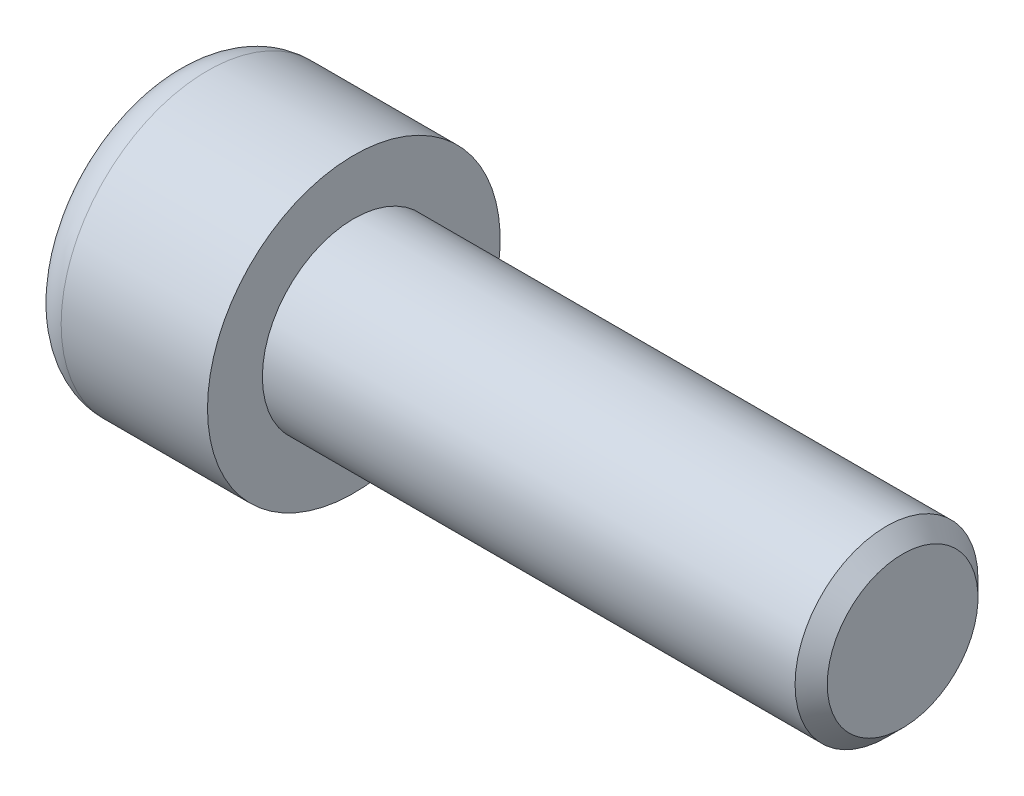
ISO-10303-21;
HEADER;
FILE_DESCRIPTION(('STEP AP214'),'2;1');
FILE_NAME('part.step','',(''),(''),'','','');
FILE_SCHEMA(('AUTOMOTIVE_DESIGN { 1 0 10303 214 1 1 1 1 }'));
ENDSEC;
DATA;
#1=APPLICATION_CONTEXT('core data for automotive mechanical design processes');
#2=APPLICATION_PROTOCOL_DEFINITION('international standard','automotive_design',2000,#1);
#3=PRODUCT_CONTEXT('',#1,'mechanical');
#4=PRODUCT('Part','Part','',(#3));
#5=PRODUCT_RELATED_PRODUCT_CATEGORY('part','',(#4));
#6=PRODUCT_DEFINITION_FORMATION('','',#4);
#7=PRODUCT_DEFINITION_CONTEXT('part definition',#1,'design');
#8=PRODUCT_DEFINITION('design','',#6,#7);
#9=PRODUCT_DEFINITION_SHAPE('','',#8);
#10=(LENGTH_UNIT() NAMED_UNIT(*) SI_UNIT(.MILLI.,.METRE.));
#11=(NAMED_UNIT(*) PLANE_ANGLE_UNIT() SI_UNIT($,.RADIAN.));
#12=(NAMED_UNIT(*) SI_UNIT($,.STERADIAN.) SOLID_ANGLE_UNIT());
#13=UNCERTAINTY_MEASURE_WITH_UNIT(LENGTH_MEASURE(1.E-05),#10,'distance_accuracy_value','');
#14=(GEOMETRIC_REPRESENTATION_CONTEXT(3) GLOBAL_UNCERTAINTY_ASSIGNED_CONTEXT((#13)) GLOBAL_UNIT_ASSIGNED_CONTEXT((#10,
#11,#12)) REPRESENTATION_CONTEXT('',''));
#15=CARTESIAN_POINT('',(0.,0.,0.));
#16=DIRECTION('',(0.,0.,1.));
#17=DIRECTION('',(1.,0.,0.));
#18=AXIS2_PLACEMENT_3D('',#15,#16,#17);
#19=CARTESIAN_POINT('',(-12.,0.,0.));
#20=DIRECTION('',(1.,0.,0.));
#21=DIRECTION('',(0.,0.,-1.));
#22=AXIS2_PLACEMENT_3D('',#19,#20,#21);
#23=PLANE('',#22);
#24=CARTESIAN_POINT('',(-12.,0.,0.));
#25=DIRECTION('',(1.,0.,0.));
#26=DIRECTION('',(0.,0.,-1.));
#27=AXIS2_PLACEMENT_3D('',#24,#25,#26);
#28=CIRCLE('',#27,6.);
#29=CARTESIAN_POINT('',(-12.,0.,-6.));
#30=VERTEX_POINT('',#29);
#31=EDGE_CURVE('E40',#30,#30,#28,.F.);
#32=ORIENTED_EDGE('',*,*,#31,.T.);
#33=EDGE_LOOP('',(#32));
#34=FACE_BOUND('',#33,.T.);
#35=DIRECTION('',(0.,-1.,0.));
#36=VECTOR('',#35,1.);
#37=CARTESIAN_POINT('',(-12.,2.30940107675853,-4.00000000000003));
#38=LINE('',#37,#36);
#39=CARTESIAN_POINT('',(-12.,2.30940107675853,-4.00000000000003));
#40=VERTEX_POINT('',#39);
#41=CARTESIAN_POINT('',(-12.,-2.30940107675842,-3.99999999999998));
#42=VERTEX_POINT('',#41);
#43=EDGE_CURVE('E101',#40,#42,#38,.T.);
#44=ORIENTED_EDGE('',*,*,#43,.F.);
#45=DIRECTION('',(0.,-0.5,-0.866025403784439));
#46=VECTOR('',#45,1.);
#47=CARTESIAN_POINT('',(-12.,4.61880215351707,0.));
#48=LINE('',#47,#46);
#49=CARTESIAN_POINT('',(-12.,4.61880215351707,0.));
#50=VERTEX_POINT('',#49);
#51=EDGE_CURVE('E47',#50,#40,#48,.T.);
#52=ORIENTED_EDGE('',*,*,#51,.F.);
#53=DIRECTION('',(0.,0.5,-0.866025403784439));
#54=VECTOR('',#53,1.);
#55=CARTESIAN_POINT('',(-12.,4.61880215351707,0.));
#56=LINE('',#55,#54);
#57=CARTESIAN_POINT('',(-12.,2.30940107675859,4.));
#58=VERTEX_POINT('',#57);
#59=EDGE_CURVE('E115',#58,#50,#56,.T.);
#60=ORIENTED_EDGE('',*,*,#59,.F.);
#61=DIRECTION('',(0.,1.,0.));
#62=VECTOR('',#61,1.);
#63=CARTESIAN_POINT('',(-12.,2.30940107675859,4.));
#64=LINE('',#63,#62);
#65=CARTESIAN_POINT('',(-12.,-2.30940107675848,4.00000000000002));
#66=VERTEX_POINT('',#65);
#67=EDGE_CURVE('E109',#66,#58,#64,.T.);
#68=ORIENTED_EDGE('',*,*,#67,.F.);
#69=DIRECTION('',(0.,0.5,0.866025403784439));
#70=VECTOR('',#69,1.);
#71=CARTESIAN_POINT('',(-12.,-4.61880215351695,0.));
#72=LINE('',#71,#70);
#73=CARTESIAN_POINT('',(-12.,-4.61880215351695,0.));
#74=VERTEX_POINT('',#73);
#75=EDGE_CURVE('E107',#74,#66,#72,.T.);
#76=ORIENTED_EDGE('',*,*,#75,.F.);
#77=DIRECTION('',(0.,-0.5,0.866025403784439));
#78=VECTOR('',#77,1.);
#79=CARTESIAN_POINT('',(-12.,-2.30940107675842,-3.99999999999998));
#80=LINE('',#79,#78);
#81=EDGE_CURVE('E90',#42,#74,#80,.T.);
#82=ORIENTED_EDGE('',*,*,#81,.F.);
#83=EDGE_LOOP('',(#44,#52,#60,#68,#76,#82));
#84=FACE_BOUND('',#83,.T.);
#85=ADVANCED_FACE('F33',(#34,#84),#23,.F.);
#86=CARTESIAN_POINT('',(-18.8650217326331,0.,0.));
#87=DIRECTION('',(-1.,0.,0.));
#88=DIRECTION('',(0.,0.,1.));
#89=AXIS2_PLACEMENT_3D('',#86,#87,#88);
#90=CYLINDRICAL_SURFACE('',#89,8.);
#91=CARTESIAN_POINT('',(-10.,0.,0.));
#92=DIRECTION('',(1.,0.,0.));
#93=DIRECTION('',(0.,0.,-1.));
#94=AXIS2_PLACEMENT_3D('',#91,#92,#93);
#95=CIRCLE('',#94,8.);
#96=CARTESIAN_POINT('',(-10.,0.,-8.));
#97=VERTEX_POINT('',#96);
#98=EDGE_CURVE('E11',#97,#97,#95,.T.);
#99=ORIENTED_EDGE('',*,*,#98,.T.);
#100=EDGE_LOOP('',(#99));
#101=FACE_BOUND('',#100,.T.);
#102=CARTESIAN_POINT('',(-2.,0.,0.));
#103=DIRECTION('',(-1.,0.,0.));
#104=DIRECTION('',(0.,0.,1.));
#105=AXIS2_PLACEMENT_3D('',#102,#103,#104);
#106=CIRCLE('',#105,8.);
#107=CARTESIAN_POINT('',(-2.,0.,8.));
#108=VERTEX_POINT('',#107);
#109=EDGE_CURVE('E142',#108,#108,#106,.T.);
#110=ORIENTED_EDGE('',*,*,#109,.T.);
#111=EDGE_LOOP('',(#110));
#112=FACE_BOUND('',#111,.T.);
#113=ADVANCED_FACE('F166',(#101,#112),#90,.T.);
#114=CARTESIAN_POINT('',(-2.,8.00000000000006,0.));
#115=DIRECTION('',(-1.,0.,0.));
#116=DIRECTION('',(0.,0.,1.));
#117=AXIS2_PLACEMENT_3D('',#114,#115,#116);
#118=PLANE('',#117);
#119=ORIENTED_EDGE('',*,*,#109,.F.);
#120=EDGE_LOOP('',(#119));
#121=FACE_BOUND('',#120,.T.);
#122=CARTESIAN_POINT('',(-2.,0.,0.));
#123=DIRECTION('',(-1.,0.,0.));
#124=DIRECTION('',(0.,0.,1.));
#125=AXIS2_PLACEMENT_3D('',#122,#123,#124);
#126=CIRCLE('',#125,5.);
#127=CARTESIAN_POINT('',(-2.,0.,5.));
#128=VERTEX_POINT('',#127);
#129=EDGE_CURVE('E133',#128,#128,#126,.T.);
#130=ORIENTED_EDGE('',*,*,#129,.T.);
#131=EDGE_LOOP('',(#130));
#132=FACE_BOUND('',#131,.T.);
#133=ADVANCED_FACE('F170',(#121,#132),#118,.F.);
#134=CARTESIAN_POINT('',(-18.8650217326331,0.,0.));
#135=DIRECTION('',(-1.,0.,0.));
#136=DIRECTION('',(0.,0.,1.));
#137=AXIS2_PLACEMENT_3D('',#134,#135,#136);
#138=CYLINDRICAL_SURFACE('',#137,5.);
#139=CARTESIAN_POINT('',(27.12,0.,0.));
#140=DIRECTION('',(-1.,0.,0.));
#141=DIRECTION('',(0.,0.,1.));
#142=AXIS2_PLACEMENT_3D('',#139,#140,#141);
#143=CIRCLE('',#142,5.);
#144=CARTESIAN_POINT('',(27.12,0.,5.));
#145=VERTEX_POINT('',#144);
#146=EDGE_CURVE('E145',#145,#145,#143,.T.);
#147=ORIENTED_EDGE('',*,*,#146,.T.);
#148=EDGE_LOOP('',(#147));
#149=FACE_BOUND('',#148,.T.);
#150=ORIENTED_EDGE('',*,*,#129,.F.);
#151=EDGE_LOOP('',(#150));
#152=FACE_BOUND('',#151,.T.);
#153=ADVANCED_FACE('F175',(#149,#152),#138,.T.);
#154=CARTESIAN_POINT('',(28.,5.00000000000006,0.));
#155=DIRECTION('',(-1.,0.,0.));
#156=DIRECTION('',(0.,0.,1.));
#157=AXIS2_PLACEMENT_3D('',#154,#155,#156);
#158=PLANE('',#157);
#159=CARTESIAN_POINT('',(28.,0.,0.));
#160=DIRECTION('',(-1.,0.,0.));
#161=DIRECTION('',(0.,0.,1.));
#162=AXIS2_PLACEMENT_3D('',#159,#160,#161);
#163=CIRCLE('',#162,4.12000000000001);
#164=CARTESIAN_POINT('',(28.,0.,4.12000000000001));
#165=VERTEX_POINT('',#164);
#166=EDGE_CURVE('E148',#165,#165,#163,.F.);
#167=ORIENTED_EDGE('',*,*,#166,.T.);
#168=EDGE_LOOP('',(#167));
#169=FACE_BOUND('',#168,.T.);
#170=ADVANCED_FACE('F182',(#169),#158,.F.);
#171=CARTESIAN_POINT('',(27.12,0.,0.));
#172=DIRECTION('',(-1.,0.,0.));
#173=DIRECTION('',(0.,0.,1.));
#174=AXIS2_PLACEMENT_3D('',#171,#172,#173);
#175=CONICAL_SURFACE('',#174,5.,0.785398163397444);
#176=ORIENTED_EDGE('',*,*,#166,.F.);
#177=EDGE_LOOP('',(#176));
#178=FACE_BOUND('',#177,.T.);
#179=ORIENTED_EDGE('',*,*,#146,.F.);
#180=EDGE_LOOP('',(#179));
#181=FACE_BOUND('',#180,.T.);
#182=ADVANCED_FACE('F186',(#178,#181),#175,.T.);
#183=CARTESIAN_POINT('',(-3.,4.61880215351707,0.));
#184=DIRECTION('',(0.,0.866025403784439,-0.500000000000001));
#185=DIRECTION('',(0.,0.500000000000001,0.866025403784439));
#186=AXIS2_PLACEMENT_3D('',#183,#184,#185);
#187=PLANE('',#186);
#188=ORIENTED_EDGE('',*,*,#51,.T.);
#189=DIRECTION('',(-1.,0.,0.));
#190=VECTOR('',#189,1.);
#191=CARTESIAN_POINT('',(-3.,2.30940107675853,-4.00000000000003));
#192=LINE('',#191,#190);
#193=CARTESIAN_POINT('',(-3.,2.30940107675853,-4.00000000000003));
#194=VERTEX_POINT('',#193);
#195=EDGE_CURVE('E98',#194,#40,#192,.T.);
#196=ORIENTED_EDGE('',*,*,#195,.F.);
#197=DIRECTION('',(0.,-0.5,-0.866025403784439));
#198=VECTOR('',#197,1.);
#199=CARTESIAN_POINT('',(-3.,4.61880215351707,0.));
#200=LINE('',#199,#198);
#201=CARTESIAN_POINT('',(-3.,4.61880215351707,0.));
#202=VERTEX_POINT('',#201);
#203=EDGE_CURVE('E117',#202,#194,#200,.T.);
#204=ORIENTED_EDGE('',*,*,#203,.F.);
#205=DIRECTION('',(-1.,0.,0.));
#206=VECTOR('',#205,1.);
#207=CARTESIAN_POINT('',(-3.,4.61880215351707,0.));
#208=LINE('',#207,#206);
#209=EDGE_CURVE('E54',#202,#50,#208,.T.);
#210=ORIENTED_EDGE('',*,*,#209,.T.);
#211=EDGE_LOOP('',(#188,#196,#204,#210));
#212=FACE_BOUND('',#211,.T.);
#213=ADVANCED_FACE('F190',(#212),#187,.F.);
#214=CARTESIAN_POINT('',(-3.,4.61880215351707,0.));
#215=DIRECTION('',(0.,0.866025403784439,0.5));
#216=DIRECTION('',(0.,-0.5,0.866025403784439));
#217=AXIS2_PLACEMENT_3D('',#214,#215,#216);
#218=PLANE('',#217);
#219=ORIENTED_EDGE('',*,*,#59,.T.);
#220=ORIENTED_EDGE('',*,*,#209,.F.);
#221=DIRECTION('',(0.,0.5,-0.866025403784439));
#222=VECTOR('',#221,1.);
#223=CARTESIAN_POINT('',(-3.,4.61880215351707,0.));
#224=LINE('',#223,#222);
#225=CARTESIAN_POINT('',(-3.,2.30940107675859,4.));
#226=VERTEX_POINT('',#225);
#227=EDGE_CURVE('E129',#226,#202,#224,.T.);
#228=ORIENTED_EDGE('',*,*,#227,.F.);
#229=DIRECTION('',(-1.,0.,0.));
#230=VECTOR('',#229,1.);
#231=CARTESIAN_POINT('',(-3.,2.30940107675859,4.));
#232=LINE('',#231,#230);
#233=EDGE_CURVE('E134',#226,#58,#232,.T.);
#234=ORIENTED_EDGE('',*,*,#233,.T.);
#235=EDGE_LOOP('',(#219,#220,#228,#234));
#236=FACE_BOUND('',#235,.T.);
#237=ADVANCED_FACE('F194',(#236),#218,.F.);
#238=CARTESIAN_POINT('',(-3.,2.30940107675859,4.));
#239=DIRECTION('',(0.,0.,1.));
#240=DIRECTION('',(1.,0.,0.));
#241=AXIS2_PLACEMENT_3D('',#238,#239,#240);
#242=PLANE('',#241);
#243=ORIENTED_EDGE('',*,*,#67,.T.);
#244=ORIENTED_EDGE('',*,*,#233,.F.);
#245=DIRECTION('',(0.,1.,0.));
#246=VECTOR('',#245,1.);
#247=CARTESIAN_POINT('',(-3.,2.30940107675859,4.));
#248=LINE('',#247,#246);
#249=CARTESIAN_POINT('',(-3.,-2.30940107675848,4.00000000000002));
#250=VERTEX_POINT('',#249);
#251=EDGE_CURVE('E126',#250,#226,#248,.T.);
#252=ORIENTED_EDGE('',*,*,#251,.F.);
#253=DIRECTION('',(-1.,0.,0.));
#254=VECTOR('',#253,1.);
#255=CARTESIAN_POINT('',(-3.,-2.30940107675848,4.00000000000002));
#256=LINE('',#255,#254);
#257=EDGE_CURVE('E136',#250,#66,#256,.T.);
#258=ORIENTED_EDGE('',*,*,#257,.T.);
#259=EDGE_LOOP('',(#243,#244,#252,#258));
#260=FACE_BOUND('',#259,.T.);
#261=ADVANCED_FACE('F202',(#260),#242,.F.);
#262=CARTESIAN_POINT('',(-3.,-4.61880215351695,0.));
#263=DIRECTION('',(0.,-0.866025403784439,0.5));
#264=DIRECTION('',(0.,-0.500000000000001,-0.866025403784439));
#265=AXIS2_PLACEMENT_3D('',#262,#263,#264);
#266=PLANE('',#265);
#267=ORIENTED_EDGE('',*,*,#75,.T.);
#268=ORIENTED_EDGE('',*,*,#257,.F.);
#269=DIRECTION('',(0.,0.5,0.866025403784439));
#270=VECTOR('',#269,1.);
#271=CARTESIAN_POINT('',(-3.,-4.61880215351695,0.));
#272=LINE('',#271,#270);
#273=CARTESIAN_POINT('',(-3.,-4.61880215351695,0.));
#274=VERTEX_POINT('',#273);
#275=EDGE_CURVE('E123',#274,#250,#272,.T.);
#276=ORIENTED_EDGE('',*,*,#275,.F.);
#277=DIRECTION('',(-1.,0.,0.));
#278=VECTOR('',#277,1.);
#279=CARTESIAN_POINT('',(-3.,-4.61880215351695,0.));
#280=LINE('',#279,#278);
#281=EDGE_CURVE('E97',#274,#74,#280,.T.);
#282=ORIENTED_EDGE('',*,*,#281,.T.);
#283=EDGE_LOOP('',(#267,#268,#276,#282));
#284=FACE_BOUND('',#283,.T.);
#285=ADVANCED_FACE('F199',(#284),#266,.F.);
#286=CARTESIAN_POINT('',(-3.,-2.30940107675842,-3.99999999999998));
#287=DIRECTION('',(0.,-0.866025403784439,-0.5));
#288=DIRECTION('',(0.,0.5,-0.866025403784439));
#289=AXIS2_PLACEMENT_3D('',#286,#287,#288);
#290=PLANE('',#289);
#291=ORIENTED_EDGE('',*,*,#81,.T.);
#292=ORIENTED_EDGE('',*,*,#281,.F.);
#293=DIRECTION('',(0.,-0.5,0.866025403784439));
#294=VECTOR('',#293,1.);
#295=CARTESIAN_POINT('',(-3.,-2.30940107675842,-3.99999999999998));
#296=LINE('',#295,#294);
#297=CARTESIAN_POINT('',(-3.,-2.30940107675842,-3.99999999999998));
#298=VERTEX_POINT('',#297);
#299=EDGE_CURVE('E93',#298,#274,#296,.T.);
#300=ORIENTED_EDGE('',*,*,#299,.F.);
#301=DIRECTION('',(-1.,0.,0.));
#302=VECTOR('',#301,1.);
#303=CARTESIAN_POINT('',(-3.,-2.30940107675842,-3.99999999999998));
#304=LINE('',#303,#302);
#305=EDGE_CURVE('E86',#298,#42,#304,.T.);
#306=ORIENTED_EDGE('',*,*,#305,.T.);
#307=EDGE_LOOP('',(#291,#292,#300,#306));
#308=FACE_BOUND('',#307,.T.);
#309=ADVANCED_FACE('F88',(#308),#290,.F.);
#310=CARTESIAN_POINT('',(-3.,2.30940107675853,-4.00000000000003));
#311=DIRECTION('',(0.,0.,-1.));
#312=DIRECTION('',(0.,1.,0.));
#313=AXIS2_PLACEMENT_3D('',#310,#311,#312);
#314=PLANE('',#313);
#315=ORIENTED_EDGE('',*,*,#43,.T.);
#316=ORIENTED_EDGE('',*,*,#305,.F.);
#317=DIRECTION('',(0.,-1.,0.));
#318=VECTOR('',#317,1.);
#319=CARTESIAN_POINT('',(-3.,2.30940107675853,-4.00000000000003));
#320=LINE('',#319,#318);
#321=EDGE_CURVE('E120',#194,#298,#320,.T.);
#322=ORIENTED_EDGE('',*,*,#321,.F.);
#323=ORIENTED_EDGE('',*,*,#195,.T.);
#324=EDGE_LOOP('',(#315,#316,#322,#323));
#325=FACE_BOUND('',#324,.T.);
#326=ADVANCED_FACE('F102',(#325),#314,.F.);
#327=CARTESIAN_POINT('',(-3.,0.,-8.00000000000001));
#328=DIRECTION('',(-1.,0.,0.));
#329=DIRECTION('',(0.,0.,1.));
#330=AXIS2_PLACEMENT_3D('',#327,#328,#329);
#331=PLANE('',#330);
#332=ORIENTED_EDGE('',*,*,#203,.T.);
#333=ORIENTED_EDGE('',*,*,#321,.T.);
#334=ORIENTED_EDGE('',*,*,#299,.T.);
#335=ORIENTED_EDGE('',*,*,#275,.T.);
#336=ORIENTED_EDGE('',*,*,#251,.T.);
#337=ORIENTED_EDGE('',*,*,#227,.T.);
#338=EDGE_LOOP('',(#332,#333,#334,#335,#336,#337));
#339=FACE_BOUND('',#338,.T.);
#340=ADVANCED_FACE('F156',(#339),#331,.T.);
#341=CARTESIAN_POINT('',(-10.,0.,0.));
#342=DIRECTION('',(1.,0.,0.));
#343=DIRECTION('',(0.,0.,-1.));
#344=AXIS2_PLACEMENT_3D('',#341,#342,#343);
#345=TOROIDAL_SURFACE('',#344,6.,2.);
#346=ORIENTED_EDGE('',*,*,#98,.F.);
#347=EDGE_LOOP('',(#346));
#348=FACE_BOUND('',#347,.T.);
#349=ORIENTED_EDGE('',*,*,#31,.F.);
#350=EDGE_LOOP('',(#349));
#351=FACE_BOUND('',#350,.T.);
#352=ADVANCED_FACE('F154',(#348,#351),#345,.T.);
#353=CLOSED_SHELL('',(#85,#113,#133,#153,#170,#182,#213,#237,#261,#285,#309,#326,#340,#352));
#354=MANIFOLD_SOLID_BREP('B2',#353);
#355=ADVANCED_BREP_SHAPE_REPRESENTATION('',(#18,#354),#14);
#356=SHAPE_DEFINITION_REPRESENTATION(#9,#355);
ENDSEC;
END-ISO-10303-21;
